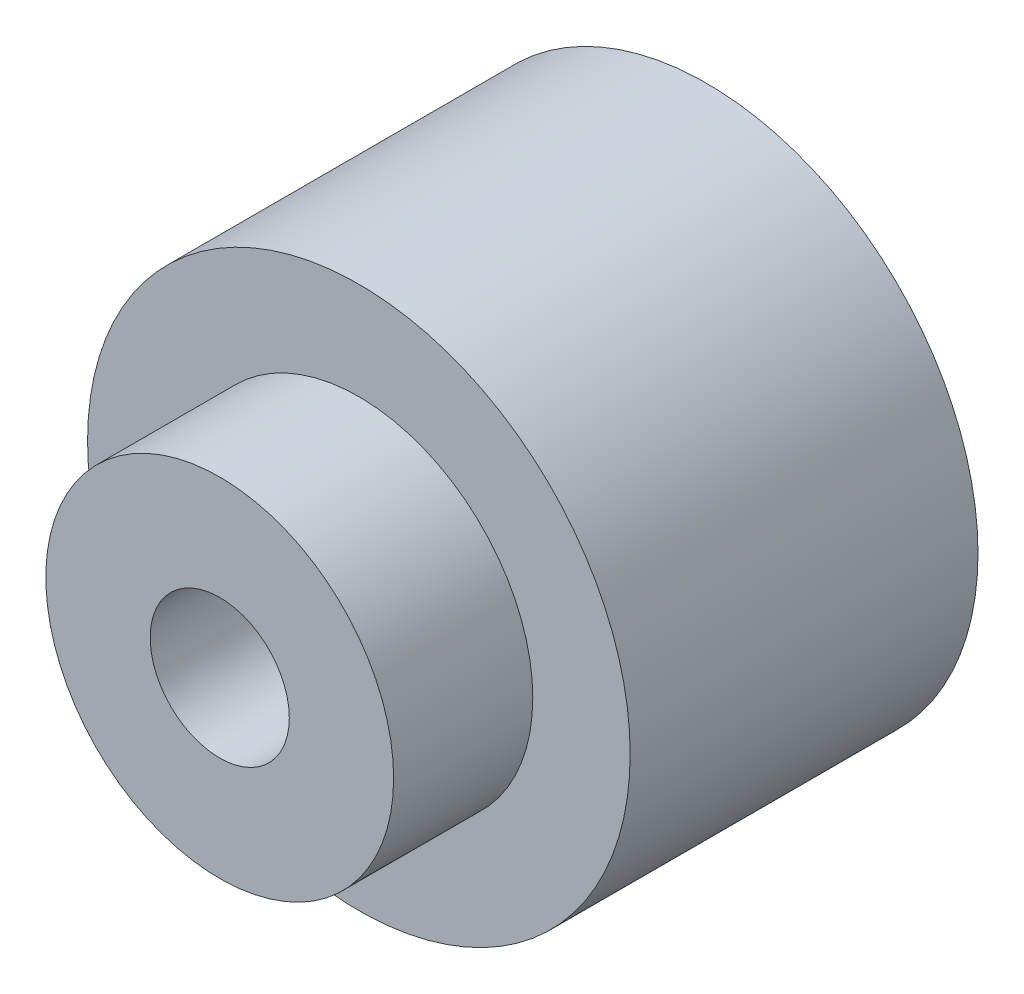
ISO-10303-21;
HEADER;
FILE_DESCRIPTION(('STEP AP214'),'2;1');
FILE_NAME('part.step','',(''),(''),'','','');
FILE_SCHEMA(('AUTOMOTIVE_DESIGN { 1 0 10303 214 1 1 1 1 }'));
ENDSEC;
DATA;
#1=APPLICATION_CONTEXT('core data for automotive mechanical design processes');
#2=APPLICATION_PROTOCOL_DEFINITION('international standard','automotive_design',2000,#1);
#3=PRODUCT_CONTEXT('',#1,'mechanical');
#4=PRODUCT('Part','Part','',(#3));
#5=PRODUCT_RELATED_PRODUCT_CATEGORY('part','',(#4));
#6=PRODUCT_DEFINITION_FORMATION('','',#4);
#7=PRODUCT_DEFINITION_CONTEXT('part definition',#1,'design');
#8=PRODUCT_DEFINITION('design','',#6,#7);
#9=PRODUCT_DEFINITION_SHAPE('','',#8);
#10=(LENGTH_UNIT() NAMED_UNIT(*) SI_UNIT(.MILLI.,.METRE.));
#11=(NAMED_UNIT(*) PLANE_ANGLE_UNIT() SI_UNIT($,.RADIAN.));
#12=(NAMED_UNIT(*) SI_UNIT($,.STERADIAN.) SOLID_ANGLE_UNIT());
#13=UNCERTAINTY_MEASURE_WITH_UNIT(LENGTH_MEASURE(1.E-05),#10,'distance_accuracy_value','');
#14=(GEOMETRIC_REPRESENTATION_CONTEXT(3) GLOBAL_UNCERTAINTY_ASSIGNED_CONTEXT((#13)) GLOBAL_UNIT_ASSIGNED_CONTEXT((#10,
#11,#12)) REPRESENTATION_CONTEXT('',''));
#15=CARTESIAN_POINT('',(0.,0.,0.));
#16=DIRECTION('',(0.,0.,1.));
#17=DIRECTION('',(1.,0.,0.));
#18=AXIS2_PLACEMENT_3D('',#15,#16,#17);
#19=CARTESIAN_POINT('',(0.,0.,50.));
#20=DIRECTION('',(0.,0.,-1.));
#21=DIRECTION('',(-1.,0.,0.));
#22=AXIS2_PLACEMENT_3D('',#19,#20,#21);
#23=CYLINDRICAL_SURFACE('',#22,39.);
#24=CARTESIAN_POINT('',(0.,0.,50.));
#25=DIRECTION('',(0.,0.,1.));
#26=DIRECTION('',(1.,0.,0.));
#27=AXIS2_PLACEMENT_3D('',#24,#25,#26);
#28=CIRCLE('',#27,39.);
#29=CARTESIAN_POINT('',(39.,0.,50.));
#30=VERTEX_POINT('',#29);
#31=EDGE_CURVE('E41',#30,#30,#28,.T.);
#32=ORIENTED_EDGE('',*,*,#31,.F.);
#33=EDGE_LOOP('',(#32));
#34=FACE_BOUND('',#33,.T.);
#35=CARTESIAN_POINT('',(0.,0.,0.));
#36=DIRECTION('',(0.,0.,1.));
#37=DIRECTION('',(1.,0.,0.));
#38=AXIS2_PLACEMENT_3D('',#35,#36,#37);
#39=CIRCLE('',#38,39.);
#40=CARTESIAN_POINT('',(39.,0.,0.));
#41=VERTEX_POINT('',#40);
#42=EDGE_CURVE('E37',#41,#41,#39,.T.);
#43=ORIENTED_EDGE('',*,*,#42,.T.);
#44=EDGE_LOOP('',(#43));
#45=FACE_BOUND('',#44,.T.);
#46=ADVANCED_FACE('F34',(#34,#45),#23,.T.);
#47=CARTESIAN_POINT('',(0.,0.,50.));
#48=DIRECTION('',(0.,0.,1.));
#49=DIRECTION('',(1.,0.,0.));
#50=AXIS2_PLACEMENT_3D('',#47,#48,#49);
#51=PLANE('',#50);
#52=CARTESIAN_POINT('',(0.,0.,50.));
#53=DIRECTION('',(0.,0.,1.));
#54=DIRECTION('',(1.,0.,0.));
#55=AXIS2_PLACEMENT_3D('',#52,#53,#54);
#56=CIRCLE('',#55,25.);
#57=CARTESIAN_POINT('',(25.,0.,50.));
#58=VERTEX_POINT('',#57);
#59=EDGE_CURVE('E10',#58,#58,#56,.T.);
#60=ORIENTED_EDGE('',*,*,#59,.F.);
#61=EDGE_LOOP('',(#60));
#62=FACE_BOUND('',#61,.T.);
#63=ORIENTED_EDGE('',*,*,#31,.T.);
#64=EDGE_LOOP('',(#63));
#65=FACE_BOUND('',#64,.T.);
#66=ADVANCED_FACE('F78',(#62,#65),#51,.T.);
#67=CARTESIAN_POINT('',(0.,0.,0.));
#68=DIRECTION('',(0.,0.,1.));
#69=DIRECTION('',(1.,0.,0.));
#70=AXIS2_PLACEMENT_3D('',#67,#68,#69);
#71=PLANE('',#70);
#72=CARTESIAN_POINT('',(0.,0.,0.));
#73=DIRECTION('',(0.,0.,1.));
#74=DIRECTION('',(1.,0.,0.));
#75=AXIS2_PLACEMENT_3D('',#72,#73,#74);
#76=CIRCLE('',#75,10.);
#77=CARTESIAN_POINT('',(10.,0.,0.));
#78=VERTEX_POINT('',#77);
#79=EDGE_CURVE('E50',#78,#78,#76,.T.);
#80=ORIENTED_EDGE('',*,*,#79,.T.);
#81=EDGE_LOOP('',(#80));
#82=FACE_BOUND('',#81,.T.);
#83=ORIENTED_EDGE('',*,*,#42,.F.);
#84=EDGE_LOOP('',(#83));
#85=FACE_BOUND('',#84,.T.);
#86=ADVANCED_FACE('F57',(#82,#85),#71,.F.);
#87=CARTESIAN_POINT('',(0.,0.,70.));
#88=DIRECTION('',(0.,0.,-1.));
#89=DIRECTION('',(-1.,0.,0.));
#90=AXIS2_PLACEMENT_3D('',#87,#88,#89);
#91=CYLINDRICAL_SURFACE('',#90,25.);
#92=CARTESIAN_POINT('',(0.,0.,70.));
#93=DIRECTION('',(0.,0.,1.));
#94=DIRECTION('',(1.,0.,0.));
#95=AXIS2_PLACEMENT_3D('',#92,#93,#94);
#96=CIRCLE('',#95,25.);
#97=CARTESIAN_POINT('',(25.,0.,70.));
#98=VERTEX_POINT('',#97);
#99=EDGE_CURVE('E47',#98,#98,#96,.T.);
#100=ORIENTED_EDGE('',*,*,#99,.F.);
#101=EDGE_LOOP('',(#100));
#102=FACE_BOUND('',#101,.T.);
#103=ORIENTED_EDGE('',*,*,#59,.T.);
#104=EDGE_LOOP('',(#103));
#105=FACE_BOUND('',#104,.T.);
#106=ADVANCED_FACE('F69',(#102,#105),#91,.T.);
#107=CARTESIAN_POINT('',(0.,0.,70.));
#108=DIRECTION('',(0.,0.,1.));
#109=DIRECTION('',(1.,0.,0.));
#110=AXIS2_PLACEMENT_3D('',#107,#108,#109);
#111=PLANE('',#110);
#112=CARTESIAN_POINT('',(0.,0.,70.));
#113=DIRECTION('',(0.,0.,1.));
#114=DIRECTION('',(1.,0.,0.));
#115=AXIS2_PLACEMENT_3D('',#112,#113,#114);
#116=CIRCLE('',#115,10.);
#117=CARTESIAN_POINT('',(10.,0.,70.));
#118=VERTEX_POINT('',#117);
#119=EDGE_CURVE('E51',#118,#118,#116,.T.);
#120=ORIENTED_EDGE('',*,*,#119,.F.);
#121=EDGE_LOOP('',(#120));
#122=FACE_BOUND('',#121,.T.);
#123=ORIENTED_EDGE('',*,*,#99,.T.);
#124=EDGE_LOOP('',(#123));
#125=FACE_BOUND('',#124,.T.);
#126=ADVANCED_FACE('F63',(#122,#125),#111,.T.);
#127=CARTESIAN_POINT('',(0.,0.,0.));
#128=DIRECTION('',(0.,0.,1.));
#129=DIRECTION('',(1.,0.,0.));
#130=AXIS2_PLACEMENT_3D('',#127,#128,#129);
#131=CYLINDRICAL_SURFACE('',#130,10.);
#132=ORIENTED_EDGE('',*,*,#79,.F.);
#133=EDGE_LOOP('',(#132));
#134=FACE_BOUND('',#133,.T.);
#135=ORIENTED_EDGE('',*,*,#119,.T.);
#136=EDGE_LOOP('',(#135));
#137=FACE_BOUND('',#136,.T.);
#138=ADVANCED_FACE('F60',(#134,#137),#131,.F.);
#139=CLOSED_SHELL('',(#46,#66,#86,#106,#126,#138));
#140=MANIFOLD_SOLID_BREP('B2',#139);
#141=ADVANCED_BREP_SHAPE_REPRESENTATION('',(#18,#140),#14);
#142=SHAPE_DEFINITION_REPRESENTATION(#9,#141);
ENDSEC;
END-ISO-10303-21;
